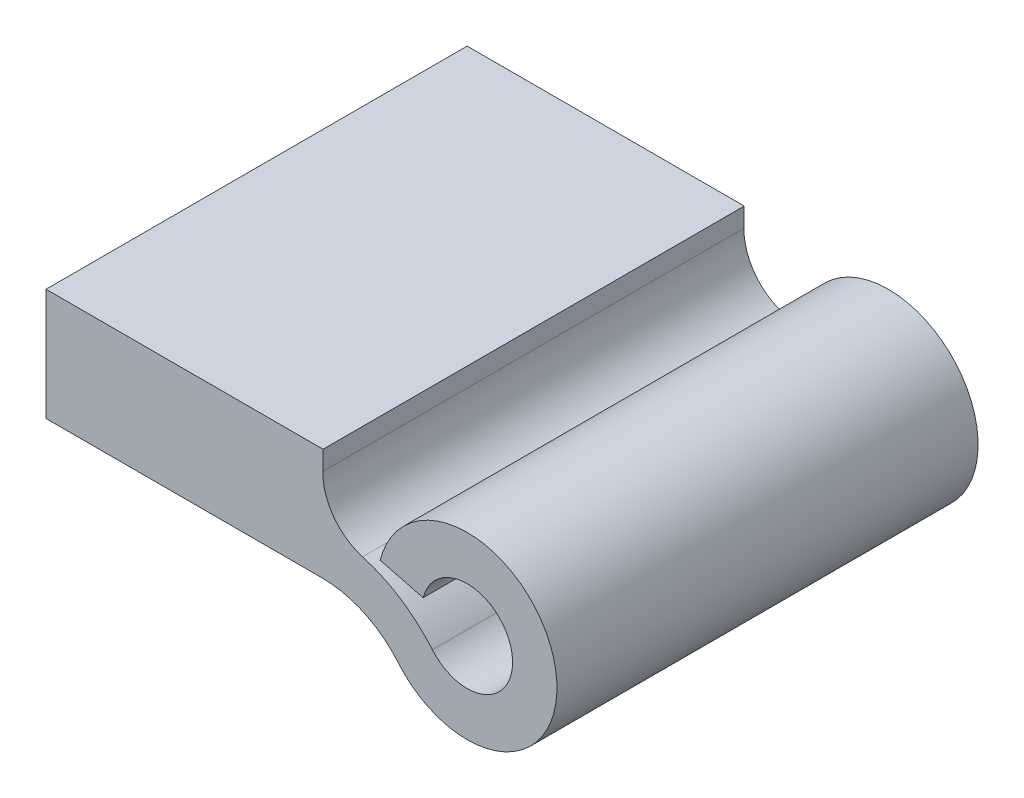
ISO-10303-21;
HEADER;
FILE_DESCRIPTION(('STEP AP214'),'2;1');
FILE_NAME('part.step','',(''),(''),'','','');
FILE_SCHEMA(('AUTOMOTIVE_DESIGN { 1 0 10303 214 1 1 1 1 }'));
ENDSEC;
DATA;
#1=APPLICATION_CONTEXT('core data for automotive mechanical design processes');
#2=APPLICATION_PROTOCOL_DEFINITION('international standard','automotive_design',2000,#1);
#3=PRODUCT_CONTEXT('',#1,'mechanical');
#4=PRODUCT('Part','Part','',(#3));
#5=PRODUCT_RELATED_PRODUCT_CATEGORY('part','',(#4));
#6=PRODUCT_DEFINITION_FORMATION('','',#4);
#7=PRODUCT_DEFINITION_CONTEXT('part definition',#1,'design');
#8=PRODUCT_DEFINITION('design','',#6,#7);
#9=PRODUCT_DEFINITION_SHAPE('','',#8);
#10=(LENGTH_UNIT() NAMED_UNIT(*) SI_UNIT(.MILLI.,.METRE.));
#11=(NAMED_UNIT(*) PLANE_ANGLE_UNIT() SI_UNIT($,.RADIAN.));
#12=(NAMED_UNIT(*) SI_UNIT($,.STERADIAN.) SOLID_ANGLE_UNIT());
#13=UNCERTAINTY_MEASURE_WITH_UNIT(LENGTH_MEASURE(1.E-05),#10,'distance_accuracy_value','');
#14=(GEOMETRIC_REPRESENTATION_CONTEXT(3) GLOBAL_UNCERTAINTY_ASSIGNED_CONTEXT((#13)) GLOBAL_UNIT_ASSIGNED_CONTEXT((#10,
#11,#12)) REPRESENTATION_CONTEXT('',''));
#15=CARTESIAN_POINT('',(0.,0.,0.));
#16=DIRECTION('',(0.,0.,1.));
#17=DIRECTION('',(1.,0.,0.));
#18=AXIS2_PLACEMENT_3D('',#15,#16,#17);
#19=CARTESIAN_POINT('',(-38.,8.09999999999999,38.));
#20=DIRECTION('',(0.,-1.,0.));
#21=DIRECTION('',(1.,0.,0.));
#22=AXIS2_PLACEMENT_3D('',#19,#20,#21);
#23=PLANE('',#22);
#24=DIRECTION('',(-1.,0.,0.));
#25=VECTOR('',#24,1.);
#26=CARTESIAN_POINT('',(-38.,8.09999999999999,0.));
#27=LINE('',#26,#25);
#28=CARTESIAN_POINT('',(-13.,8.1,0.));
#29=VERTEX_POINT('',#28);
#30=CARTESIAN_POINT('',(-38.,8.09999999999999,0.));
#31=VERTEX_POINT('',#30);
#32=EDGE_CURVE('E104',#29,#31,#27,.T.);
#33=ORIENTED_EDGE('',*,*,#32,.T.);
#34=DIRECTION('',(0.,0.,-1.));
#35=VECTOR('',#34,1.);
#36=CARTESIAN_POINT('',(-38.,8.09999999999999,38.));
#37=LINE('',#36,#35);
#38=CARTESIAN_POINT('',(-38.,8.09999999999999,38.));
#39=VERTEX_POINT('',#38);
#40=EDGE_CURVE('E11',#39,#31,#37,.T.);
#41=ORIENTED_EDGE('',*,*,#40,.F.);
#42=DIRECTION('',(-1.,0.,0.));
#43=VECTOR('',#42,1.);
#44=CARTESIAN_POINT('',(-38.,8.09999999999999,38.));
#45=LINE('',#44,#43);
#46=CARTESIAN_POINT('',(-13.,8.1,38.));
#47=VERTEX_POINT('',#46);
#48=EDGE_CURVE('E135',#47,#39,#45,.T.);
#49=ORIENTED_EDGE('',*,*,#48,.F.);
#50=DIRECTION('',(0.,0.,-1.));
#51=VECTOR('',#50,1.);
#52=CARTESIAN_POINT('',(-13.,8.1,38.));
#53=LINE('',#52,#51);
#54=EDGE_CURVE('E117',#47,#29,#53,.T.);
#55=ORIENTED_EDGE('',*,*,#54,.T.);
#56=EDGE_LOOP('',(#33,#41,#49,#55));
#57=FACE_BOUND('',#56,.T.);
#58=ADVANCED_FACE('F24',(#57),#23,.F.);
#59=CARTESIAN_POINT('',(-38.,2.,38.));
#60=DIRECTION('',(1.,0.,0.));
#61=DIRECTION('',(0.,0.,-1.));
#62=AXIS2_PLACEMENT_3D('',#59,#60,#61);
#63=PLANE('',#62);
#64=DIRECTION('',(0.,-1.,0.));
#65=VECTOR('',#64,1.);
#66=CARTESIAN_POINT('',(-38.,2.,0.));
#67=LINE('',#66,#65);
#68=CARTESIAN_POINT('',(-38.,-2.00000000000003,0.));
#69=VERTEX_POINT('',#68);
#70=EDGE_CURVE('E100',#31,#69,#67,.T.);
#71=ORIENTED_EDGE('',*,*,#70,.T.);
#72=DIRECTION('',(0.,0.,-1.));
#73=VECTOR('',#72,1.);
#74=CARTESIAN_POINT('',(-38.,-2.00000000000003,38.));
#75=LINE('',#74,#73);
#76=CARTESIAN_POINT('',(-38.,-2.00000000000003,38.));
#77=VERTEX_POINT('',#76);
#78=EDGE_CURVE('E31',#77,#69,#75,.T.);
#79=ORIENTED_EDGE('',*,*,#78,.F.);
#80=DIRECTION('',(0.,-1.,0.));
#81=VECTOR('',#80,1.);
#82=CARTESIAN_POINT('',(-38.,2.,38.));
#83=LINE('',#82,#81);
#84=EDGE_CURVE('E113',#39,#77,#83,.T.);
#85=ORIENTED_EDGE('',*,*,#84,.F.);
#86=ORIENTED_EDGE('',*,*,#40,.T.);
#87=EDGE_LOOP('',(#71,#79,#85,#86));
#88=FACE_BOUND('',#87,.T.);
#89=ADVANCED_FACE('F112',(#88),#63,.F.);
#90=CARTESIAN_POINT('',(-38.,-2.00000000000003,38.));
#91=DIRECTION('',(0.,1.,0.));
#92=DIRECTION('',(-1.,0.,0.));
#93=AXIS2_PLACEMENT_3D('',#90,#91,#92);
#94=PLANE('',#93);
#95=DIRECTION('',(1.,0.,0.));
#96=VECTOR('',#95,1.);
#97=CARTESIAN_POINT('',(-38.,-2.00000000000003,0.));
#98=LINE('',#97,#96);
#99=CARTESIAN_POINT('',(-13.0923641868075,-2.00000000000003,0.));
#100=VERTEX_POINT('',#99);
#101=EDGE_CURVE('E106',#69,#100,#98,.T.);
#102=ORIENTED_EDGE('',*,*,#101,.T.);
#103=DIRECTION('',(0.,0.,-1.));
#104=VECTOR('',#103,1.);
#105=CARTESIAN_POINT('',(-13.0923641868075,-2.00000000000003,38.));
#106=LINE('',#105,#104);
#107=CARTESIAN_POINT('',(-13.0923641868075,-2.00000000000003,38.));
#108=VERTEX_POINT('',#107);
#109=EDGE_CURVE('E171',#108,#100,#106,.T.);
#110=ORIENTED_EDGE('',*,*,#109,.F.);
#111=DIRECTION('',(1.,0.,0.));
#112=VECTOR('',#111,1.);
#113=CARTESIAN_POINT('',(-38.,-2.00000000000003,38.));
#114=LINE('',#113,#112);
#115=EDGE_CURVE('E138',#77,#108,#114,.T.);
#116=ORIENTED_EDGE('',*,*,#115,.F.);
#117=ORIENTED_EDGE('',*,*,#78,.T.);
#118=EDGE_LOOP('',(#102,#110,#116,#117));
#119=FACE_BOUND('',#118,.T.);
#120=ADVANCED_FACE('F175',(#119),#94,.F.);
#121=CARTESIAN_POINT('',(-13.0923641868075,-10.9999999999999,38.));
#122=DIRECTION('',(0.,0.,-1.));
#123=DIRECTION('',(-1.,0.,0.));
#124=AXIS2_PLACEMENT_3D('',#121,#122,#123);
#125=CYLINDRICAL_SURFACE('',#124,8.9999999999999);
#126=CARTESIAN_POINT('',(-13.0923641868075,-10.9999999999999,0.));
#127=DIRECTION('',(0.,0.,-1.));
#128=DIRECTION('',(1.,0.,0.));
#129=AXIS2_PLACEMENT_3D('',#126,#127,#128);
#130=CIRCLE('',#129,8.9999999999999);
#131=CARTESIAN_POINT('',(-6.20164619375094,-5.21052631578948,0.));
#132=VERTEX_POINT('',#131);
#133=EDGE_CURVE('E121',#100,#132,#130,.T.);
#134=ORIENTED_EDGE('',*,*,#133,.T.);
#135=DIRECTION('',(0.,0.,-1.));
#136=VECTOR('',#135,1.);
#137=CARTESIAN_POINT('',(-6.20164619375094,-5.21052631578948,38.));
#138=LINE('',#137,#136);
#139=CARTESIAN_POINT('',(-6.20164619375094,-5.21052631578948,38.));
#140=VERTEX_POINT('',#139);
#141=EDGE_CURVE('E168',#140,#132,#138,.T.);
#142=ORIENTED_EDGE('',*,*,#141,.F.);
#143=CARTESIAN_POINT('',(-13.0923641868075,-10.9999999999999,38.));
#144=DIRECTION('',(0.,0.,-1.));
#145=DIRECTION('',(1.,0.,0.));
#146=AXIS2_PLACEMENT_3D('',#143,#144,#145);
#147=CIRCLE('',#146,8.9999999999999);
#148=EDGE_CURVE('E140',#108,#140,#147,.T.);
#149=ORIENTED_EDGE('',*,*,#148,.F.);
#150=ORIENTED_EDGE('',*,*,#109,.T.);
#151=EDGE_LOOP('',(#134,#142,#149,#150));
#152=FACE_BOUND('',#151,.T.);
#153=ADVANCED_FACE('F183',(#152),#125,.F.);
#154=CARTESIAN_POINT('',(0.,0.,38.));
#155=DIRECTION('',(0.,0.,-1.));
#156=DIRECTION('',(-1.,0.,0.));
#157=AXIS2_PLACEMENT_3D('',#154,#155,#156);
#158=CYLINDRICAL_SURFACE('',#157,8.10000000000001);
#159=CARTESIAN_POINT('',(0.,0.,0.));
#160=DIRECTION('',(0.,0.,1.));
#161=DIRECTION('',(1.,0.,0.));
#162=AXIS2_PLACEMENT_3D('',#159,#160,#161);
#163=CIRCLE('',#162,8.10000000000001);
#164=CARTESIAN_POINT('',(-7.84920378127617,2.,0.));
#165=VERTEX_POINT('',#164);
#166=EDGE_CURVE('E123',#132,#165,#163,.T.);
#167=ORIENTED_EDGE('',*,*,#166,.T.);
#168=DIRECTION('',(0.,0.,-1.));
#169=VECTOR('',#168,1.);
#170=CARTESIAN_POINT('',(-7.84920378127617,2.,38.));
#171=LINE('',#170,#169);
#172=CARTESIAN_POINT('',(-7.84920378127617,2.,38.));
#173=VERTEX_POINT('',#172);
#174=EDGE_CURVE('E165',#173,#165,#171,.T.);
#175=ORIENTED_EDGE('',*,*,#174,.F.);
#176=CARTESIAN_POINT('',(0.,0.,38.));
#177=DIRECTION('',(0.,0.,1.));
#178=DIRECTION('',(1.,0.,0.));
#179=AXIS2_PLACEMENT_3D('',#176,#177,#178);
#180=CIRCLE('',#179,8.10000000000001);
#181=EDGE_CURVE('E142',#140,#173,#180,.T.);
#182=ORIENTED_EDGE('',*,*,#181,.F.);
#183=ORIENTED_EDGE('',*,*,#141,.T.);
#184=EDGE_LOOP('',(#167,#175,#182,#183));
#185=FACE_BOUND('',#184,.T.);
#186=ADVANCED_FACE('F186',(#185),#158,.T.);
#187=CARTESIAN_POINT('',(-7.84920378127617,2.,38.));
#188=DIRECTION('',(0.246913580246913,0.969037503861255,0.));
#189=DIRECTION('',(-0.969037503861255,0.246913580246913,0.));
#190=AXIS2_PLACEMENT_3D('',#187,#188,#189);
#191=PLANE('',#190);
#192=DIRECTION('',(0.969037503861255,-0.246913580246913,0.));
#193=VECTOR('',#192,1.);
#194=CARTESIAN_POINT('',(-7.84920378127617,2.,0.));
#195=LINE('',#194,#193);
#196=CARTESIAN_POINT('',(-3.97305376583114,1.01234567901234,0.));
#197=VERTEX_POINT('',#196);
#198=EDGE_CURVE('E125',#165,#197,#195,.T.);
#199=ORIENTED_EDGE('',*,*,#198,.T.);
#200=DIRECTION('',(0.,0.,-1.));
#201=VECTOR('',#200,1.);
#202=CARTESIAN_POINT('',(-3.97305376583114,1.01234567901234,38.));
#203=LINE('',#202,#201);
#204=CARTESIAN_POINT('',(-3.97305376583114,1.01234567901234,38.));
#205=VERTEX_POINT('',#204);
#206=EDGE_CURVE('E162',#205,#197,#203,.T.);
#207=ORIENTED_EDGE('',*,*,#206,.F.);
#208=DIRECTION('',(0.969037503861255,-0.246913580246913,0.));
#209=VECTOR('',#208,1.);
#210=CARTESIAN_POINT('',(-7.84920378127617,2.,38.));
#211=LINE('',#210,#209);
#212=EDGE_CURVE('E144',#173,#205,#211,.T.);
#213=ORIENTED_EDGE('',*,*,#212,.F.);
#214=ORIENTED_EDGE('',*,*,#174,.T.);
#215=EDGE_LOOP('',(#199,#207,#213,#214));
#216=FACE_BOUND('',#215,.T.);
#217=ADVANCED_FACE('F191',(#216),#191,.F.);
#218=CARTESIAN_POINT('',(0.,0.,38.));
#219=DIRECTION('',(0.,0.,-1.));
#220=DIRECTION('',(-1.,0.,0.));
#221=AXIS2_PLACEMENT_3D('',#218,#219,#220);
#222=CYLINDRICAL_SURFACE('',#221,4.1);
#223=CARTESIAN_POINT('',(0.,0.,0.));
#224=DIRECTION('',(0.,0.,-1.));
#225=DIRECTION('',(1.,0.,0.));
#226=AXIS2_PLACEMENT_3D('',#223,#224,#225);
#227=CIRCLE('',#226,4.1);
#228=CARTESIAN_POINT('',(-3.13910486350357,-2.63742690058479,0.));
#229=VERTEX_POINT('',#228);
#230=EDGE_CURVE('E127',#197,#229,#227,.T.);
#231=ORIENTED_EDGE('',*,*,#230,.T.);
#232=DIRECTION('',(0.,0.,-1.));
#233=VECTOR('',#232,1.);
#234=CARTESIAN_POINT('',(-3.13910486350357,-2.63742690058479,38.));
#235=LINE('',#234,#233);
#236=CARTESIAN_POINT('',(-3.13910486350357,-2.63742690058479,38.));
#237=VERTEX_POINT('',#236);
#238=EDGE_CURVE('E159',#237,#229,#235,.T.);
#239=ORIENTED_EDGE('',*,*,#238,.F.);
#240=CARTESIAN_POINT('',(0.,0.,38.));
#241=DIRECTION('',(0.,0.,-1.));
#242=DIRECTION('',(1.,0.,0.));
#243=AXIS2_PLACEMENT_3D('',#240,#241,#242);
#244=CIRCLE('',#243,4.1);
#245=EDGE_CURVE('E146',#205,#237,#244,.T.);
#246=ORIENTED_EDGE('',*,*,#245,.F.);
#247=ORIENTED_EDGE('',*,*,#206,.T.);
#248=EDGE_LOOP('',(#231,#239,#246,#247));
#249=FACE_BOUND('',#248,.T.);
#250=ADVANCED_FACE('F197',(#249),#222,.F.);
#251=CARTESIAN_POINT('',(-13.0923641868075,-10.9999999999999,38.));
#252=DIRECTION('',(0.,0.,-1.));
#253=DIRECTION('',(-1.,0.,0.));
#254=AXIS2_PLACEMENT_3D('',#251,#252,#253);
#255=CYLINDRICAL_SURFACE('',#254,12.9999999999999);
#256=CARTESIAN_POINT('',(-13.0923641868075,-10.9999999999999,0.));
#257=DIRECTION('',(0.,0.,1.));
#258=DIRECTION('',(1.,0.,0.));
#259=AXIS2_PLACEMENT_3D('',#256,#257,#258);
#260=CIRCLE('',#259,12.9999999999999);
#261=CARTESIAN_POINT('',(-9.43411536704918,1.47466294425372,0.));
#262=VERTEX_POINT('',#261);
#263=EDGE_CURVE('E129',#229,#262,#260,.T.);
#264=ORIENTED_EDGE('',*,*,#263,.T.);
#265=DIRECTION('',(0.,0.,-1.));
#266=VECTOR('',#265,1.);
#267=CARTESIAN_POINT('',(-9.43411536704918,1.47466294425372,38.));
#268=LINE('',#267,#266);
#269=CARTESIAN_POINT('',(-9.43411536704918,1.47466294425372,38.));
#270=VERTEX_POINT('',#269);
#271=EDGE_CURVE('E156',#270,#262,#268,.T.);
#272=ORIENTED_EDGE('',*,*,#271,.F.);
#273=CARTESIAN_POINT('',(-13.0923641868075,-10.9999999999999,38.));
#274=DIRECTION('',(0.,0.,1.));
#275=DIRECTION('',(1.,0.,0.));
#276=AXIS2_PLACEMENT_3D('',#273,#274,#275);
#277=CIRCLE('',#276,12.9999999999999);
#278=EDGE_CURVE('E148',#237,#270,#277,.T.);
#279=ORIENTED_EDGE('',*,*,#278,.F.);
#280=ORIENTED_EDGE('',*,*,#238,.T.);
#281=EDGE_LOOP('',(#264,#272,#279,#280));
#282=FACE_BOUND('',#281,.T.);
#283=ADVANCED_FACE('F201',(#282),#255,.T.);
#284=CARTESIAN_POINT('',(-8.02709659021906,6.27261023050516,38.));
#285=DIRECTION('',(0.,0.,-1.));
#286=DIRECTION('',(-1.,0.,0.));
#287=AXIS2_PLACEMENT_3D('',#284,#285,#286);
#288=CYLINDRICAL_SURFACE('',#287,5.);
#289=CARTESIAN_POINT('',(-8.02709659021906,6.27261023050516,0.));
#290=DIRECTION('',(0.,0.,-1.));
#291=DIRECTION('',(-1.,0.,0.));
#292=AXIS2_PLACEMENT_3D('',#289,#290,#291);
#293=CIRCLE('',#292,5.);
#294=CARTESIAN_POINT('',(-13.0265235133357,6.34830990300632,0.));
#295=VERTEX_POINT('',#294);
#296=EDGE_CURVE('E131',#262,#295,#293,.T.);
#297=ORIENTED_EDGE('',*,*,#296,.T.);
#298=DIRECTION('',(0.,0.,-1.));
#299=VECTOR('',#298,1.);
#300=CARTESIAN_POINT('',(-13.0265235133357,6.34830990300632,38.));
#301=LINE('',#300,#299);
#302=CARTESIAN_POINT('',(-13.0265235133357,6.34830990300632,38.));
#303=VERTEX_POINT('',#302);
#304=EDGE_CURVE('E153',#303,#295,#301,.T.);
#305=ORIENTED_EDGE('',*,*,#304,.F.);
#306=CARTESIAN_POINT('',(-8.02709659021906,6.27261023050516,38.));
#307=DIRECTION('',(0.,0.,-1.));
#308=DIRECTION('',(-1.,0.,0.));
#309=AXIS2_PLACEMENT_3D('',#306,#307,#308);
#310=CIRCLE('',#309,5.);
#311=EDGE_CURVE('E43',#270,#303,#310,.T.);
#312=ORIENTED_EDGE('',*,*,#311,.F.);
#313=ORIENTED_EDGE('',*,*,#271,.T.);
#314=EDGE_LOOP('',(#297,#305,#312,#313));
#315=FACE_BOUND('',#314,.T.);
#316=ADVANCED_FACE('F204',(#315),#288,.F.);
#317=CARTESIAN_POINT('',(-13.,8.1,38.));
#318=DIRECTION('',(-0.999885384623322,0.0151399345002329,0.));
#319=DIRECTION('',(-0.0151399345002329,-0.999885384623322,0.));
#320=AXIS2_PLACEMENT_3D('',#317,#318,#319);
#321=PLANE('',#320);
#322=DIRECTION('',(0.0151399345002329,0.999885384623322,0.));
#323=VECTOR('',#322,1.);
#324=CARTESIAN_POINT('',(-13.,8.1,0.));
#325=LINE('',#324,#323);
#326=EDGE_CURVE('E133',#295,#29,#325,.T.);
#327=ORIENTED_EDGE('',*,*,#326,.T.);
#328=ORIENTED_EDGE('',*,*,#54,.F.);
#329=DIRECTION('',(0.0151399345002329,0.999885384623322,0.));
#330=VECTOR('',#329,1.);
#331=CARTESIAN_POINT('',(-13.,8.1,38.));
#332=LINE('',#331,#330);
#333=EDGE_CURVE('E38',#303,#47,#332,.T.);
#334=ORIENTED_EDGE('',*,*,#333,.F.);
#335=ORIENTED_EDGE('',*,*,#304,.T.);
#336=EDGE_LOOP('',(#327,#328,#334,#335));
#337=FACE_BOUND('',#336,.T.);
#338=ADVANCED_FACE('F206',(#337),#321,.F.);
#339=CARTESIAN_POINT('',(-8.02709659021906,6.27261023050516,38.));
#340=DIRECTION('',(0.,0.,-1.));
#341=DIRECTION('',(-1.,0.,0.));
#342=AXIS2_PLACEMENT_3D('',#339,#340,#341);
#343=PLANE('',#342);
#344=ORIENTED_EDGE('',*,*,#48,.T.);
#345=ORIENTED_EDGE('',*,*,#84,.T.);
#346=ORIENTED_EDGE('',*,*,#115,.T.);
#347=ORIENTED_EDGE('',*,*,#148,.T.);
#348=ORIENTED_EDGE('',*,*,#181,.T.);
#349=ORIENTED_EDGE('',*,*,#212,.T.);
#350=ORIENTED_EDGE('',*,*,#245,.T.);
#351=ORIENTED_EDGE('',*,*,#278,.T.);
#352=ORIENTED_EDGE('',*,*,#311,.T.);
#353=ORIENTED_EDGE('',*,*,#333,.T.);
#354=EDGE_LOOP('',(#344,#345,#346,#347,#348,#349,#350,#351,#352,#353));
#355=FACE_BOUND('',#354,.T.);
#356=ADVANCED_FACE('F178',(#355),#343,.F.);
#357=CARTESIAN_POINT('',(-8.02709659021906,6.27261023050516,0.));
#358=DIRECTION('',(0.,0.,-1.));
#359=DIRECTION('',(-1.,0.,0.));
#360=AXIS2_PLACEMENT_3D('',#357,#358,#359);
#361=PLANE('',#360);
#362=ORIENTED_EDGE('',*,*,#32,.F.);
#363=ORIENTED_EDGE('',*,*,#326,.F.);
#364=ORIENTED_EDGE('',*,*,#296,.F.);
#365=ORIENTED_EDGE('',*,*,#263,.F.);
#366=ORIENTED_EDGE('',*,*,#230,.F.);
#367=ORIENTED_EDGE('',*,*,#198,.F.);
#368=ORIENTED_EDGE('',*,*,#166,.F.);
#369=ORIENTED_EDGE('',*,*,#133,.F.);
#370=ORIENTED_EDGE('',*,*,#101,.F.);
#371=ORIENTED_EDGE('',*,*,#70,.F.);
#372=EDGE_LOOP('',(#362,#363,#364,#365,#366,#367,#368,#369,#370,#371));
#373=FACE_BOUND('',#372,.T.);
#374=ADVANCED_FACE('F101',(#373),#361,.T.);
#375=CLOSED_SHELL('',(#58,#89,#120,#153,#186,#217,#250,#283,#316,#338,#356,#374));
#376=MANIFOLD_SOLID_BREP('B2',#375);
#377=ADVANCED_BREP_SHAPE_REPRESENTATION('',(#18,#376),#14);
#378=SHAPE_DEFINITION_REPRESENTATION(#9,#377);
ENDSEC;
END-ISO-10303-21;
